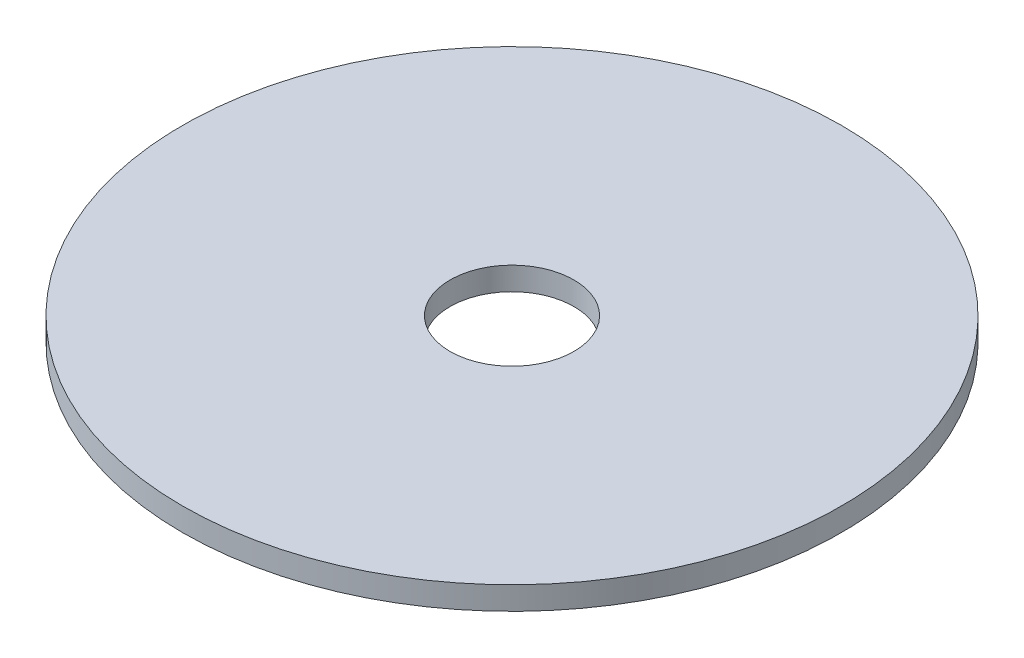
from build123d import *

# Parameters (mm, degrees)
SKETCH1_R           = 12.7
BOSS_EXTRUDE1_DEPTH = 0.889
SKETCH5_R           = 2.3876
CUT_EXTRUDE1_DEPTH  = 18.98250041


with BuildPart() as part:
    # Sketch1 → Boss-Extrude1 (new body)
    with BuildSketch(Plane(origin=(0, 0, 0), x_dir=(1, 0, 0), z_dir=(0, 1, 0))):
        with Locations(Location((0, 0, 0), (0, 0, 270))):
            Circle(SKETCH1_R)
    extrude(amount=BOSS_EXTRUDE1_DEPTH)

    # Sketch5 → Cut-Extrude1 (cut, through all)
    with BuildSketch(Plane(origin=(0, 0.889, 0), x_dir=(-1, 0, 0), z_dir=(0, 1, 0))):
        with Locations(Location((0, 0, 0), (0, 0, 90))):
            Circle(SKETCH5_R)
    extrude(amount=-CUT_EXTRUDE1_DEPTH, mode=Mode.SUBTRACT)


solid = part.part
